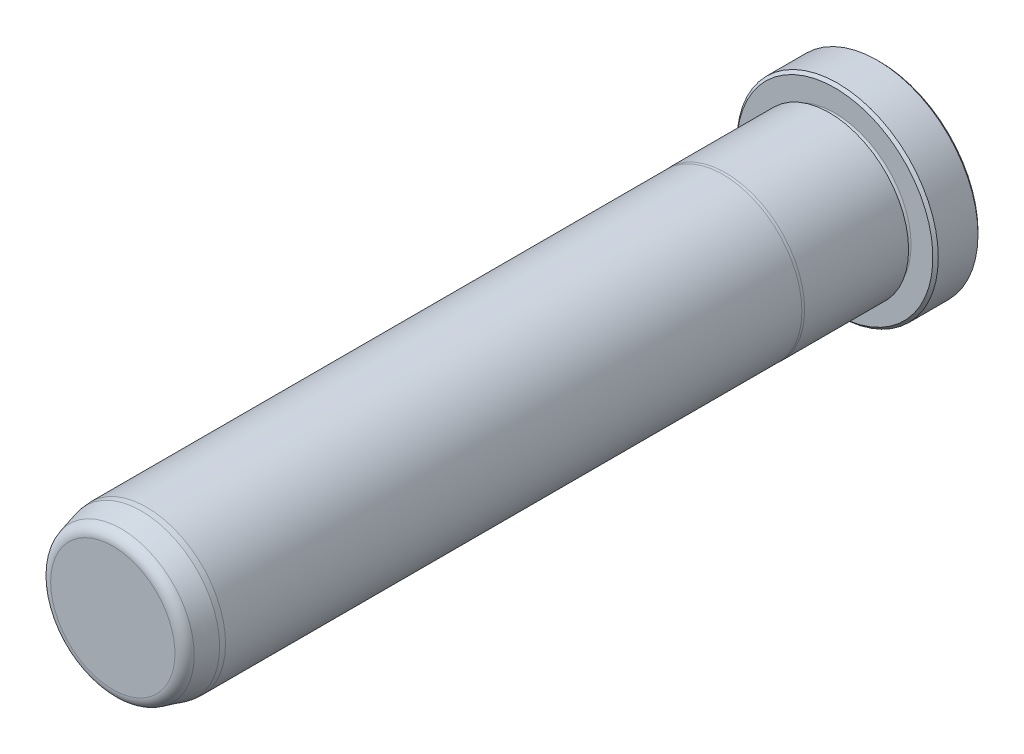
from build123d import *

# Parameters (mm, degrees)
FILLET6_R     = 1.5875
CHAMFER1_SIZE = 0.381


with BuildPart() as part:
    # Sketch1 → Revolve1 (revolve)
    with BuildSketch(Plane(origin=(0, 0, 0), x_dir=(0, 0, -1), z_dir=(1, 0, 0)), mode=Mode.PRIVATE) as revolve1_sk:
        with BuildLine():
            Line((0, 0), (0, 14.1605))
            Line((0, 14.1605), (-6.35, 14.1605))
            Line((-6.35, 14.1605), (-6.35, 10.7188))
            ThreePointArc((-6.35, 10.7188), (-6.731, 10.3378), (-7.112, 10.7188))
            Line((-7.112, 10.7188), (-7.112, 11.1252))
            Line((-7.112, 11.1252), (-21.734763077, 11.1252))
            Line((-21.734763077, 11.1252), (-22.098, 11.0998))
            Line((-22.098, 11.0998), (-103.1875, 11.0998))
            Line((-103.1875, 11.0998), (-103.9495, 11.033133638))
            Line((-103.9495, 11.033133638), (-107.95, 9.961202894))
            Line((-107.95, 9.961202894), (-107.95, 0))
            Line((-107.95, 0), (0, 0))
        make_face()
    revolve(revolve1_sk.sketch.rotate(Axis((0, 0, 0), (0, 0, -1)), 90), axis=Axis((0, 0, 0), (0, 0, -1)))

    # Fillet6
    fillet6_edges = [part.edges().sort_by_distance(p)[0] for p in [
        (-9.961202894, 0, 107.95),
    ]]
    fillet(fillet6_edges, radius=FILLET6_R)

    # Chamfer1
    chamfer1_edges = [part.edges().sort_by_distance(p)[0] for p in [
        (-14.1605, 0, 6.35),
        (-14.1605, 0, 0),
    ]]
    chamfer(chamfer1_edges, length=CHAMFER1_SIZE)


solid = part.part
